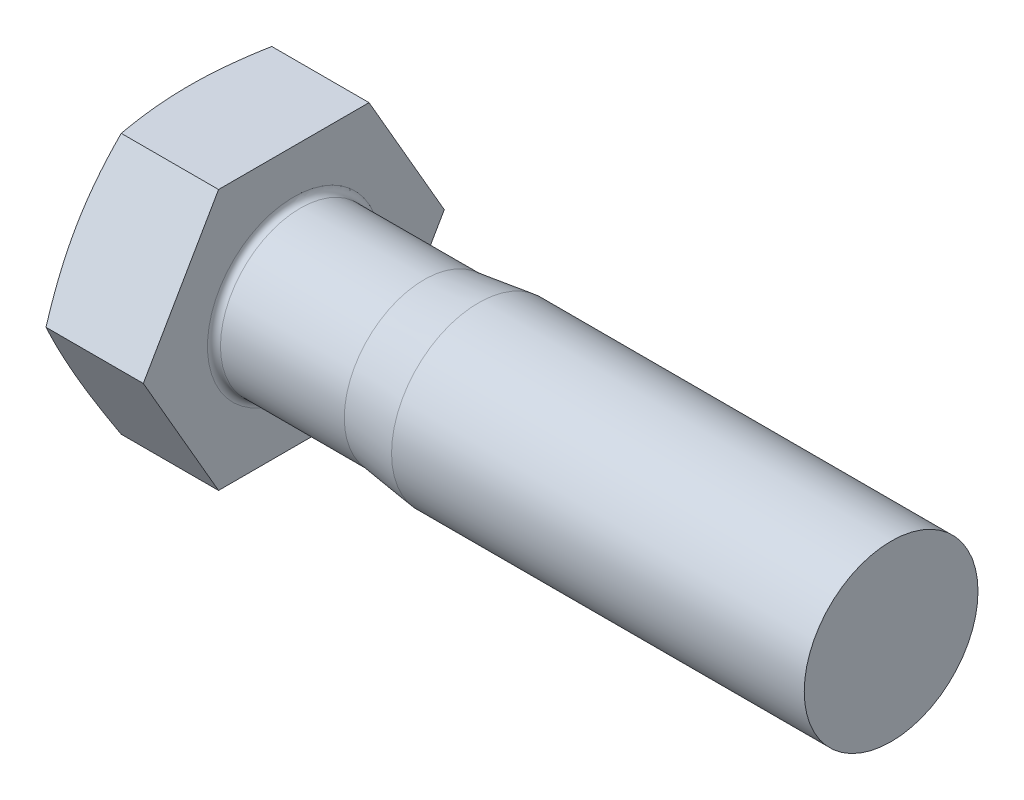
from build123d import *

# Parameters (mm, degrees)
BASEHEAD_DEPTH     = 10
SKETCH2_R          = 8
BASEBODY_DEPTH     = 55
SKETCH4_R          = 8.85
CUT_EXTRUDE1_DEPTH = 2
HEADFILLET_R       = 0.6


with BuildPart() as part:
    # Sketch1 → BaseHead (new body)
    with BuildSketch(Plane(origin=(0, 0, 0), x_dir=(0, 0, -1), z_dir=(1, 0, 0))):
        Polygon((13.856406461, 0), (6.92820323, 12), (-6.92820323, 12), (-13.856406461, 0), (-6.92820323, -12), (6.92820323, -12), align=None)
    extrude(amount=BASEHEAD_DEPTH)

    # Sketch2 → BaseBody (add)
    with BuildSketch(Plane(origin=(10, 0, 0), x_dir=(0, 0, -1), z_dir=(1, 0, 0))):
        Circle(SKETCH2_R)
    extrude(amount=BASEBODY_DEPTH)

    # Sketch3 → HeadChamfer (revolve, cut)
    with BuildSketch(Plane(origin=(3.161211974, 0, 2.612290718), x_dir=(0, 0, -1), z_dir=(0, 1, 0)), mode=Mode.PRIVATE) as headchamfer_sk:
        Polygon((16.468697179, 3.161211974), (16.468697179, 2.121565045), (13.612290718, 3.161211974), align=None)
    revolve(headchamfer_sk.sketch.rotate(Axis((-2.071354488, 0, 0), (1, 0, 0)), 180), axis=Axis((-2.071354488, 0, 0), (1, 0, 0)), mode=Mode.SUBTRACT)

    # Sketch4 → Cut-Extrude1 (cut)
    with BuildSketch(Plane.ZY):
        Circle(SKETCH4_R)
    extrude(amount=-CUT_EXTRUDE1_DEPTH, mode=Mode.SUBTRACT)

    # Sketch5 → Cut-Revolve1 (revolve, cut)
    with BuildSketch(Plane(origin=(-2.67963122, 0, 8.17963122), x_dir=(0, 0, -1), z_dir=(0, 1, 0)), mode=Mode.PRIVATE) as cut_revolve1_sk:
        Polygon((16.17963122, -29.67963122), (15.53013122, -24.67963122), (15.53013122, -12.67963122), (22.88063122, -12.67963122), (22.88063122, -29.67963122), align=None)
    revolve(cut_revolve1_sk.sketch.rotate(Axis((-2.697175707, 0, 0), (1, 0, 0)), 180), axis=Axis((-2.697175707, 0, 0), (1, 0, 0)), mode=Mode.SUBTRACT)

    # HeadFillet
    headfillet_edges = [part.edges().sort_by_distance(p)[0] for p in [
        (10, 0, -7.3505),
    ]]
    fillet(headfillet_edges, radius=HEADFILLET_R)


solid = part.part
